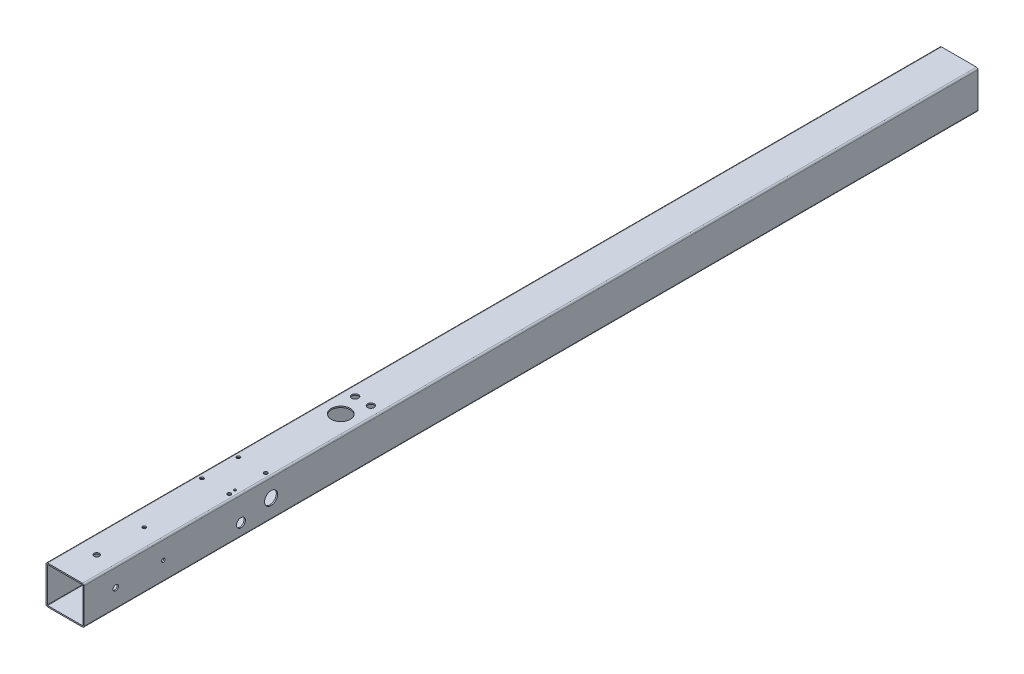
ISO-10303-21;
HEADER;
FILE_DESCRIPTION(('STEP AP214'),'2;1');
FILE_NAME('part.step','',(''),(''),'','','');
FILE_SCHEMA(('AUTOMOTIVE_DESIGN { 1 0 10303 214 1 1 1 1 }'));
ENDSEC;
DATA;
#1=APPLICATION_CONTEXT('core data for automotive mechanical design processes');
#2=APPLICATION_PROTOCOL_DEFINITION('international standard','automotive_design',2000,#1);
#3=PRODUCT_CONTEXT('',#1,'mechanical');
#4=PRODUCT('Part','Part','',(#3));
#5=PRODUCT_RELATED_PRODUCT_CATEGORY('part','',(#4));
#6=PRODUCT_DEFINITION_FORMATION('','',#4);
#7=PRODUCT_DEFINITION_CONTEXT('part definition',#1,'design');
#8=PRODUCT_DEFINITION('design','',#6,#7);
#9=PRODUCT_DEFINITION_SHAPE('','',#8);
#10=(LENGTH_UNIT() NAMED_UNIT(*) SI_UNIT(.MILLI.,.METRE.));
#11=(NAMED_UNIT(*) PLANE_ANGLE_UNIT() SI_UNIT($,.RADIAN.));
#12=(NAMED_UNIT(*) SI_UNIT($,.STERADIAN.) SOLID_ANGLE_UNIT());
#13=UNCERTAINTY_MEASURE_WITH_UNIT(LENGTH_MEASURE(1.E-05),#10,'distance_accuracy_value','');
#14=(GEOMETRIC_REPRESENTATION_CONTEXT(3) GLOBAL_UNCERTAINTY_ASSIGNED_CONTEXT((#13)) GLOBAL_UNIT_ASSIGNED_CONTEXT((#10,
#11,#12)) REPRESENTATION_CONTEXT('',''));
#15=CARTESIAN_POINT('',(0.,0.,0.));
#16=DIRECTION('',(0.,0.,1.));
#17=DIRECTION('',(1.,0.,0.));
#18=AXIS2_PLACEMENT_3D('',#15,#16,#17);
#19=CARTESIAN_POINT('',(115.,-115.,2820.));
#20=DIRECTION('',(0.,0.,1.));
#21=DIRECTION('',(1.,0.,0.));
#22=AXIS2_PLACEMENT_3D('',#19,#20,#21);
#23=PLANE('',#22);
#24=CARTESIAN_POINT('',(115.,-115.,2820.));
#25=DIRECTION('',(0.,0.,1.));
#26=DIRECTION('',(1.,0.,0.));
#27=AXIS2_PLACEMENT_3D('',#24,#25,#26);
#28=CIRCLE('',#27,5.);
#29=CARTESIAN_POINT('',(115.,-120.,2820.));
#30=VERTEX_POINT('',#29);
#31=CARTESIAN_POINT('',(120.,-115.,2820.));
#32=VERTEX_POINT('',#31);
#33=EDGE_CURVE('E234',#30,#32,#28,.T.);
#34=ORIENTED_EDGE('',*,*,#33,.T.);
#35=DIRECTION('',(0.,1.,0.));
#36=VECTOR('',#35,1.);
#37=CARTESIAN_POINT('',(120.,-5.00000000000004,2820.));
#38=LINE('',#37,#36);
#39=CARTESIAN_POINT('',(120.,-5.00000000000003,2820.));
#40=VERTEX_POINT('',#39);
#41=EDGE_CURVE('E237',#32,#40,#38,.T.);
#42=ORIENTED_EDGE('',*,*,#41,.T.);
#43=CARTESIAN_POINT('',(115.,-5.,2820.));
#44=DIRECTION('',(0.,0.,1.));
#45=DIRECTION('',(1.,0.,0.));
#46=AXIS2_PLACEMENT_3D('',#43,#44,#45);
#47=CIRCLE('',#46,5.);
#48=CARTESIAN_POINT('',(115.,0.,2820.));
#49=VERTEX_POINT('',#48);
#50=EDGE_CURVE('E239',#40,#49,#47,.T.);
#51=ORIENTED_EDGE('',*,*,#50,.T.);
#52=DIRECTION('',(-1.,0.,0.));
#53=VECTOR('',#52,1.);
#54=CARTESIAN_POINT('',(5.00000000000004,0.,2820.));
#55=LINE('',#54,#53);
#56=CARTESIAN_POINT('',(5.00000000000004,0.,2820.));
#57=VERTEX_POINT('',#56);
#58=EDGE_CURVE('E241',#49,#57,#55,.T.);
#59=ORIENTED_EDGE('',*,*,#58,.T.);
#60=CARTESIAN_POINT('',(5.,-5.,2820.));
#61=DIRECTION('',(0.,0.,1.));
#62=DIRECTION('',(1.,0.,0.));
#63=AXIS2_PLACEMENT_3D('',#60,#61,#62);
#64=CIRCLE('',#63,5.);
#65=CARTESIAN_POINT('',(0.,-5.00000000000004,2820.));
#66=VERTEX_POINT('',#65);
#67=EDGE_CURVE('E243',#57,#66,#64,.T.);
#68=ORIENTED_EDGE('',*,*,#67,.T.);
#69=DIRECTION('',(0.,-1.,0.));
#70=VECTOR('',#69,1.);
#71=CARTESIAN_POINT('',(0.,-5.00000000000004,2820.));
#72=LINE('',#71,#70);
#73=CARTESIAN_POINT('',(0.,-115.,2820.));
#74=VERTEX_POINT('',#73);
#75=EDGE_CURVE('E245',#66,#74,#72,.T.);
#76=ORIENTED_EDGE('',*,*,#75,.T.);
#77=CARTESIAN_POINT('',(5.00000000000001,-115.,2820.));
#78=DIRECTION('',(0.,0.,1.));
#79=DIRECTION('',(1.,0.,0.));
#80=AXIS2_PLACEMENT_3D('',#77,#78,#79);
#81=CIRCLE('',#80,5.);
#82=CARTESIAN_POINT('',(5.00000000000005,-120.,2820.));
#83=VERTEX_POINT('',#82);
#84=EDGE_CURVE('E247',#74,#83,#81,.T.);
#85=ORIENTED_EDGE('',*,*,#84,.T.);
#86=DIRECTION('',(1.,0.,0.));
#87=VECTOR('',#86,1.);
#88=CARTESIAN_POINT('',(5.00000000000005,-120.,2820.));
#89=LINE('',#88,#87);
#90=EDGE_CURVE('E249',#83,#30,#89,.T.);
#91=ORIENTED_EDGE('',*,*,#90,.T.);
#92=EDGE_LOOP('',(#34,#42,#51,#59,#68,#76,#85,#91));
#93=FACE_BOUND('',#92,.T.);
#94=DIRECTION('',(-1.,0.,0.));
#95=VECTOR('',#94,1.);
#96=CARTESIAN_POINT('',(5.00000000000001,-4.,2820.));
#97=LINE('',#96,#95);
#98=CARTESIAN_POINT('',(115.,-4.,2820.));
#99=VERTEX_POINT('',#98);
#100=CARTESIAN_POINT('',(5.00000000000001,-4.,2820.));
#101=VERTEX_POINT('',#100);
#102=EDGE_CURVE('E192',#99,#101,#97,.T.);
#103=ORIENTED_EDGE('',*,*,#102,.F.);
#104=CARTESIAN_POINT('',(115.,-5.,2820.));
#105=DIRECTION('',(0.,0.,1.));
#106=DIRECTION('',(1.,0.,0.));
#107=AXIS2_PLACEMENT_3D('',#104,#105,#106);
#108=CIRCLE('',#107,1.);
#109=CARTESIAN_POINT('',(116.,-5.00000000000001,2820.));
#110=VERTEX_POINT('',#109);
#111=EDGE_CURVE('E163',#110,#99,#108,.T.);
#112=ORIENTED_EDGE('',*,*,#111,.F.);
#113=DIRECTION('',(0.,1.,0.));
#114=VECTOR('',#113,1.);
#115=CARTESIAN_POINT('',(116.,-5.00000000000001,2820.));
#116=LINE('',#115,#114);
#117=CARTESIAN_POINT('',(116.,-115.,2820.));
#118=VERTEX_POINT('',#117);
#119=EDGE_CURVE('E204',#118,#110,#116,.T.);
#120=ORIENTED_EDGE('',*,*,#119,.F.);
#121=CARTESIAN_POINT('',(115.,-115.,2820.));
#122=DIRECTION('',(0.,0.,1.));
#123=DIRECTION('',(1.,0.,0.));
#124=AXIS2_PLACEMENT_3D('',#121,#122,#123);
#125=CIRCLE('',#124,1.);
#126=CARTESIAN_POINT('',(115.,-116.,2820.));
#127=VERTEX_POINT('',#126);
#128=EDGE_CURVE('E202',#127,#118,#125,.T.);
#129=ORIENTED_EDGE('',*,*,#128,.F.);
#130=DIRECTION('',(1.,0.,0.));
#131=VECTOR('',#130,1.);
#132=CARTESIAN_POINT('',(5.00000000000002,-116.,2820.));
#133=LINE('',#132,#131);
#134=CARTESIAN_POINT('',(5.00000000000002,-116.,2820.));
#135=VERTEX_POINT('',#134);
#136=EDGE_CURVE('E200',#135,#127,#133,.T.);
#137=ORIENTED_EDGE('',*,*,#136,.F.);
#138=CARTESIAN_POINT('',(5.00000000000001,-115.,2820.));
#139=DIRECTION('',(0.,0.,1.));
#140=DIRECTION('',(1.,0.,0.));
#141=AXIS2_PLACEMENT_3D('',#138,#139,#140);
#142=CIRCLE('',#141,1.);
#143=CARTESIAN_POINT('',(4.00000000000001,-115.,2820.));
#144=VERTEX_POINT('',#143);
#145=EDGE_CURVE('E198',#144,#135,#142,.T.);
#146=ORIENTED_EDGE('',*,*,#145,.F.);
#147=DIRECTION('',(0.,-1.,0.));
#148=VECTOR('',#147,1.);
#149=CARTESIAN_POINT('',(4.,-5.00000000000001,2820.));
#150=LINE('',#149,#148);
#151=CARTESIAN_POINT('',(4.,-5.00000000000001,2820.));
#152=VERTEX_POINT('',#151);
#153=EDGE_CURVE('E196',#152,#144,#150,.T.);
#154=ORIENTED_EDGE('',*,*,#153,.F.);
#155=CARTESIAN_POINT('',(5.,-5.,2820.));
#156=DIRECTION('',(0.,0.,1.));
#157=DIRECTION('',(1.,0.,0.));
#158=AXIS2_PLACEMENT_3D('',#155,#156,#157);
#159=CIRCLE('',#158,0.999999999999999);
#160=EDGE_CURVE('E194',#101,#152,#159,.T.);
#161=ORIENTED_EDGE('',*,*,#160,.F.);
#162=EDGE_LOOP('',(#103,#112,#120,#129,#137,#146,#154,#161));
#163=FACE_BOUND('',#162,.T.);
#164=ADVANCED_FACE('F33',(#93,#163),#23,.T.);
#165=CARTESIAN_POINT('',(115.,-115.,0.));
#166=DIRECTION('',(0.,0.,1.));
#167=DIRECTION('',(1.,0.,0.));
#168=AXIS2_PLACEMENT_3D('',#165,#166,#167);
#169=PLANE('',#168);
#170=CARTESIAN_POINT('',(115.,-115.,0.));
#171=DIRECTION('',(0.,0.,1.));
#172=DIRECTION('',(1.,0.,0.));
#173=AXIS2_PLACEMENT_3D('',#170,#171,#172);
#174=CIRCLE('',#173,5.);
#175=CARTESIAN_POINT('',(115.,-120.,0.));
#176=VERTEX_POINT('',#175);
#177=CARTESIAN_POINT('',(120.,-115.,0.));
#178=VERTEX_POINT('',#177);
#179=EDGE_CURVE('E164',#176,#178,#174,.T.);
#180=ORIENTED_EDGE('',*,*,#179,.F.);
#181=DIRECTION('',(1.,0.,0.));
#182=VECTOR('',#181,1.);
#183=CARTESIAN_POINT('',(5.00000000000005,-120.,0.));
#184=LINE('',#183,#182);
#185=CARTESIAN_POINT('',(5.00000000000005,-120.,0.));
#186=VERTEX_POINT('',#185);
#187=EDGE_CURVE('E232',#186,#176,#184,.T.);
#188=ORIENTED_EDGE('',*,*,#187,.F.);
#189=CARTESIAN_POINT('',(5.00000000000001,-115.,0.));
#190=DIRECTION('',(0.,0.,1.));
#191=DIRECTION('',(1.,0.,0.));
#192=AXIS2_PLACEMENT_3D('',#189,#190,#191);
#193=CIRCLE('',#192,5.);
#194=CARTESIAN_POINT('',(0.,-115.,0.));
#195=VERTEX_POINT('',#194);
#196=EDGE_CURVE('E230',#195,#186,#193,.T.);
#197=ORIENTED_EDGE('',*,*,#196,.F.);
#198=DIRECTION('',(0.,-1.,0.));
#199=VECTOR('',#198,1.);
#200=CARTESIAN_POINT('',(0.,-5.00000000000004,0.));
#201=LINE('',#200,#199);
#202=CARTESIAN_POINT('',(0.,-5.00000000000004,0.));
#203=VERTEX_POINT('',#202);
#204=EDGE_CURVE('E228',#203,#195,#201,.T.);
#205=ORIENTED_EDGE('',*,*,#204,.F.);
#206=CARTESIAN_POINT('',(5.,-5.,0.));
#207=DIRECTION('',(0.,0.,1.));
#208=DIRECTION('',(1.,0.,0.));
#209=AXIS2_PLACEMENT_3D('',#206,#207,#208);
#210=CIRCLE('',#209,5.);
#211=CARTESIAN_POINT('',(5.00000000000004,0.,0.));
#212=VERTEX_POINT('',#211);
#213=EDGE_CURVE('E226',#212,#203,#210,.T.);
#214=ORIENTED_EDGE('',*,*,#213,.F.);
#215=DIRECTION('',(-1.,0.,0.));
#216=VECTOR('',#215,1.);
#217=CARTESIAN_POINT('',(5.00000000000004,0.,0.));
#218=LINE('',#217,#216);
#219=CARTESIAN_POINT('',(115.,0.,0.));
#220=VERTEX_POINT('',#219);
#221=EDGE_CURVE('E224',#220,#212,#218,.T.);
#222=ORIENTED_EDGE('',*,*,#221,.F.);
#223=CARTESIAN_POINT('',(115.,-5.,0.));
#224=DIRECTION('',(0.,0.,1.));
#225=DIRECTION('',(1.,0.,0.));
#226=AXIS2_PLACEMENT_3D('',#223,#224,#225);
#227=CIRCLE('',#226,5.);
#228=CARTESIAN_POINT('',(120.,-5.00000000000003,0.));
#229=VERTEX_POINT('',#228);
#230=EDGE_CURVE('E222',#229,#220,#227,.T.);
#231=ORIENTED_EDGE('',*,*,#230,.F.);
#232=DIRECTION('',(0.,1.,0.));
#233=VECTOR('',#232,1.);
#234=CARTESIAN_POINT('',(120.,-5.00000000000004,0.));
#235=LINE('',#234,#233);
#236=EDGE_CURVE('E220',#178,#229,#235,.T.);
#237=ORIENTED_EDGE('',*,*,#236,.F.);
#238=EDGE_LOOP('',(#180,#188,#197,#205,#214,#222,#231,#237));
#239=FACE_BOUND('',#238,.T.);
#240=CARTESIAN_POINT('',(115.,-5.,0.));
#241=DIRECTION('',(0.,0.,1.));
#242=DIRECTION('',(1.,0.,0.));
#243=AXIS2_PLACEMENT_3D('',#240,#241,#242);
#244=CIRCLE('',#243,1.);
#245=CARTESIAN_POINT('',(116.,-5.,0.));
#246=VERTEX_POINT('',#245);
#247=CARTESIAN_POINT('',(115.,-4.,0.));
#248=VERTEX_POINT('',#247);
#249=EDGE_CURVE('E58',#246,#248,#244,.T.);
#250=ORIENTED_EDGE('',*,*,#249,.T.);
#251=DIRECTION('',(-1.,0.,0.));
#252=VECTOR('',#251,1.);
#253=CARTESIAN_POINT('',(5.00000000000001,-4.,0.));
#254=LINE('',#253,#252);
#255=CARTESIAN_POINT('',(5.00000000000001,-4.,0.));
#256=VERTEX_POINT('',#255);
#257=EDGE_CURVE('E150',#248,#256,#254,.T.);
#258=ORIENTED_EDGE('',*,*,#257,.T.);
#259=CARTESIAN_POINT('',(5.,-5.,0.));
#260=DIRECTION('',(0.,0.,1.));
#261=DIRECTION('',(1.,0.,0.));
#262=AXIS2_PLACEMENT_3D('',#259,#260,#261);
#263=CIRCLE('',#262,0.999999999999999);
#264=CARTESIAN_POINT('',(4.,-5.00000000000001,0.));
#265=VERTEX_POINT('',#264);
#266=EDGE_CURVE('E159',#256,#265,#263,.T.);
#267=ORIENTED_EDGE('',*,*,#266,.T.);
#268=DIRECTION('',(0.,-1.,0.));
#269=VECTOR('',#268,1.);
#270=CARTESIAN_POINT('',(4.,-5.00000000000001,0.));
#271=LINE('',#270,#269);
#272=CARTESIAN_POINT('',(4.00000000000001,-115.,0.));
#273=VERTEX_POINT('',#272);
#274=EDGE_CURVE('E179',#265,#273,#271,.T.);
#275=ORIENTED_EDGE('',*,*,#274,.T.);
#276=CARTESIAN_POINT('',(5.00000000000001,-115.,0.));
#277=DIRECTION('',(0.,0.,1.));
#278=DIRECTION('',(1.,0.,0.));
#279=AXIS2_PLACEMENT_3D('',#276,#277,#278);
#280=CIRCLE('',#279,1.);
#281=CARTESIAN_POINT('',(5.00000000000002,-116.,0.));
#282=VERTEX_POINT('',#281);
#283=EDGE_CURVE('E182',#273,#282,#280,.T.);
#284=ORIENTED_EDGE('',*,*,#283,.T.);
#285=DIRECTION('',(1.,0.,0.));
#286=VECTOR('',#285,1.);
#287=CARTESIAN_POINT('',(5.00000000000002,-116.,0.));
#288=LINE('',#287,#286);
#289=CARTESIAN_POINT('',(115.,-116.,0.));
#290=VERTEX_POINT('',#289);
#291=EDGE_CURVE('E185',#282,#290,#288,.T.);
#292=ORIENTED_EDGE('',*,*,#291,.T.);
#293=CARTESIAN_POINT('',(115.,-115.,0.));
#294=DIRECTION('',(0.,0.,1.));
#295=DIRECTION('',(1.,0.,0.));
#296=AXIS2_PLACEMENT_3D('',#293,#294,#295);
#297=CIRCLE('',#296,1.);
#298=CARTESIAN_POINT('',(116.,-115.,0.));
#299=VERTEX_POINT('',#298);
#300=EDGE_CURVE('E188',#290,#299,#297,.T.);
#301=ORIENTED_EDGE('',*,*,#300,.T.);
#302=DIRECTION('',(0.,1.,0.));
#303=VECTOR('',#302,1.);
#304=CARTESIAN_POINT('',(116.,-5.00000000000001,0.));
#305=LINE('',#304,#303);
#306=EDGE_CURVE('E169',#299,#246,#305,.T.);
#307=ORIENTED_EDGE('',*,*,#306,.T.);
#308=EDGE_LOOP('',(#250,#258,#267,#275,#284,#292,#301,#307));
#309=FACE_BOUND('',#308,.T.);
#310=ADVANCED_FACE('F167',(#239,#309),#169,.F.);
#311=CARTESIAN_POINT('',(115.,-115.,2820.));
#312=DIRECTION('',(0.,0.,-1.));
#313=DIRECTION('',(-1.,0.,0.));
#314=AXIS2_PLACEMENT_3D('',#311,#312,#313);
#315=CYLINDRICAL_SURFACE('',#314,5.);
#316=ORIENTED_EDGE('',*,*,#179,.T.);
#317=DIRECTION('',(0.,0.,-1.));
#318=VECTOR('',#317,1.);
#319=CARTESIAN_POINT('',(120.,-115.,2820.));
#320=LINE('',#319,#318);
#321=EDGE_CURVE('E11',#32,#178,#320,.T.);
#322=ORIENTED_EDGE('',*,*,#321,.F.);
#323=ORIENTED_EDGE('',*,*,#33,.F.);
#324=DIRECTION('',(0.,0.,-1.));
#325=VECTOR('',#324,1.);
#326=CARTESIAN_POINT('',(115.,-120.,2820.));
#327=LINE('',#326,#325);
#328=EDGE_CURVE('E251',#30,#176,#327,.T.);
#329=ORIENTED_EDGE('',*,*,#328,.T.);
#330=EDGE_LOOP('',(#316,#322,#323,#329));
#331=FACE_BOUND('',#330,.T.);
#332=ADVANCED_FACE('F35',(#331),#315,.T.);
#333=CARTESIAN_POINT('',(120.,-5.00000000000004,2820.));
#334=DIRECTION('',(-1.,0.,0.));
#335=DIRECTION('',(0.,0.,1.));
#336=AXIS2_PLACEMENT_3D('',#333,#334,#335);
#337=PLANE('',#336);
#338=CARTESIAN_POINT('',(120.,-60.,2230.));
#339=DIRECTION('',(-1.,0.,0.));
#340=DIRECTION('',(0.,-1.,0.));
#341=AXIS2_PLACEMENT_3D('',#338,#339,#340);
#342=CIRCLE('',#341,20.5000000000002);
#343=CARTESIAN_POINT('',(120.,-80.5000000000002,2230.));
#344=VERTEX_POINT('',#343);
#345=EDGE_CURVE('E322',#344,#344,#342,.T.);
#346=ORIENTED_EDGE('',*,*,#345,.T.);
#347=EDGE_LOOP('',(#346));
#348=FACE_BOUND('',#347,.T.);
#349=CARTESIAN_POINT('',(120.,-80.,2325.));
#350=DIRECTION('',(-1.,0.,0.));
#351=DIRECTION('',(0.,-1.,0.));
#352=AXIS2_PLACEMENT_3D('',#349,#350,#351);
#353=CIRCLE('',#352,13.9999999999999);
#354=CARTESIAN_POINT('',(120.,-93.9999999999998,2325.));
#355=VERTEX_POINT('',#354);
#356=EDGE_CURVE('E317',#355,#355,#353,.T.);
#357=ORIENTED_EDGE('',*,*,#356,.T.);
#358=EDGE_LOOP('',(#357));
#359=FACE_BOUND('',#358,.T.);
#360=CARTESIAN_POINT('',(120.,-60.,2570.));
#361=DIRECTION('',(-1.,0.,0.));
#362=DIRECTION('',(0.,-1.,0.));
#363=AXIS2_PLACEMENT_3D('',#360,#361,#362);
#364=CIRCLE('',#363,5.49999999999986);
#365=CARTESIAN_POINT('',(120.,-65.4999999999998,2570.));
#366=VERTEX_POINT('',#365);
#367=EDGE_CURVE('E312',#366,#366,#364,.T.);
#368=ORIENTED_EDGE('',*,*,#367,.T.);
#369=EDGE_LOOP('',(#368));
#370=FACE_BOUND('',#369,.T.);
#371=CARTESIAN_POINT('',(120.,-60.,2720.));
#372=DIRECTION('',(-1.,0.,0.));
#373=DIRECTION('',(0.,-1.,0.));
#374=AXIS2_PLACEMENT_3D('',#371,#372,#373);
#375=CIRCLE('',#374,8.50000000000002);
#376=CARTESIAN_POINT('',(120.,-68.5,2720.));
#377=VERTEX_POINT('',#376);
#378=EDGE_CURVE('E307',#377,#377,#375,.T.);
#379=ORIENTED_EDGE('',*,*,#378,.T.);
#380=EDGE_LOOP('',(#379));
#381=FACE_BOUND('',#380,.T.);
#382=ORIENTED_EDGE('',*,*,#236,.T.);
#383=DIRECTION('',(0.,0.,-1.));
#384=VECTOR('',#383,1.);
#385=CARTESIAN_POINT('',(120.,-5.00000000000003,2820.));
#386=LINE('',#385,#384);
#387=EDGE_CURVE('E42',#40,#229,#386,.T.);
#388=ORIENTED_EDGE('',*,*,#387,.F.);
#389=ORIENTED_EDGE('',*,*,#41,.F.);
#390=ORIENTED_EDGE('',*,*,#321,.T.);
#391=EDGE_LOOP('',(#382,#388,#389,#390));
#392=FACE_BOUND('',#391,.T.);
#393=ADVANCED_FACE('F429',(#348,#359,#370,#381,#392),#337,.F.);
#394=CARTESIAN_POINT('',(115.,-5.,2820.));
#395=DIRECTION('',(0.,0.,-1.));
#396=DIRECTION('',(-1.,0.,0.));
#397=AXIS2_PLACEMENT_3D('',#394,#395,#396);
#398=CYLINDRICAL_SURFACE('',#397,5.);
#399=ORIENTED_EDGE('',*,*,#230,.T.);
#400=DIRECTION('',(0.,0.,-1.));
#401=VECTOR('',#400,1.);
#402=CARTESIAN_POINT('',(115.,0.,2820.));
#403=LINE('',#402,#401);
#404=EDGE_CURVE('E266',#49,#220,#403,.T.);
#405=ORIENTED_EDGE('',*,*,#404,.F.);
#406=ORIENTED_EDGE('',*,*,#50,.F.);
#407=ORIENTED_EDGE('',*,*,#387,.T.);
#408=EDGE_LOOP('',(#399,#405,#406,#407));
#409=FACE_BOUND('',#408,.T.);
#410=ADVANCED_FACE('F392',(#409),#398,.T.);
#411=CARTESIAN_POINT('',(5.00000000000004,0.,2820.));
#412=DIRECTION('',(0.,-1.,0.));
#413=DIRECTION('',(0.,0.,-1.));
#414=AXIS2_PLACEMENT_3D('',#411,#412,#413);
#415=PLANE('',#414);
#416=CARTESIAN_POINT('',(101.,0.,2325.));
#417=DIRECTION('',(0.,-1.,0.));
#418=DIRECTION('',(0.,0.,-1.));
#419=AXIS2_PLACEMENT_3D('',#416,#417,#418);
#420=CIRCLE('',#419,3.49999999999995);
#421=CARTESIAN_POINT('',(101.,0.,2321.5));
#422=VERTEX_POINT('',#421);
#423=EDGE_CURVE('E554',#422,#422,#420,.T.);
#424=ORIENTED_EDGE('',*,*,#423,.T.);
#425=EDGE_LOOP('',(#424));
#426=FACE_BOUND('',#425,.T.);
#427=CARTESIAN_POINT('',(85.,0.,1880.));
#428=DIRECTION('',(0.,1.,0.));
#429=DIRECTION('',(0.,0.,1.));
#430=AXIS2_PLACEMENT_3D('',#427,#428,#429);
#431=CIRCLE('',#430,10.5);
#432=CARTESIAN_POINT('',(85.,0.,1890.5));
#433=VERTEX_POINT('',#432);
#434=EDGE_CURVE('E302',#433,#433,#431,.T.);
#435=ORIENTED_EDGE('',*,*,#434,.F.);
#436=EDGE_LOOP('',(#435));
#437=FACE_BOUND('',#436,.T.);
#438=CARTESIAN_POINT('',(35.,0.,1880.));
#439=DIRECTION('',(0.,1.,0.));
#440=DIRECTION('',(0.,0.,1.));
#441=AXIS2_PLACEMENT_3D('',#438,#439,#440);
#442=CIRCLE('',#441,10.5);
#443=CARTESIAN_POINT('',(35.,0.,1890.5));
#444=VERTEX_POINT('',#443);
#445=EDGE_CURVE('E298',#444,#444,#442,.T.);
#446=ORIENTED_EDGE('',*,*,#445,.F.);
#447=EDGE_LOOP('',(#446));
#448=FACE_BOUND('',#447,.T.);
#449=CARTESIAN_POINT('',(103.,0.,2230.));
#450=DIRECTION('',(0.,1.,0.));
#451=DIRECTION('',(0.,0.,1.));
#452=AXIS2_PLACEMENT_3D('',#449,#450,#451);
#453=CIRCLE('',#452,5.49999999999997);
#454=CARTESIAN_POINT('',(103.,0.,2235.5));
#455=VERTEX_POINT('',#454);
#456=EDGE_CURVE('E294',#455,#455,#453,.T.);
#457=ORIENTED_EDGE('',*,*,#456,.F.);
#458=EDGE_LOOP('',(#457));
#459=FACE_BOUND('',#458,.T.);
#460=CARTESIAN_POINT('',(103.,0.,2345.));
#461=DIRECTION('',(0.,1.,0.));
#462=DIRECTION('',(0.,0.,1.));
#463=AXIS2_PLACEMENT_3D('',#460,#461,#462);
#464=CIRCLE('',#463,5.49999999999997);
#465=CARTESIAN_POINT('',(103.,0.,2350.5));
#466=VERTEX_POINT('',#465);
#467=EDGE_CURVE('E290',#466,#466,#464,.T.);
#468=ORIENTED_EDGE('',*,*,#467,.F.);
#469=EDGE_LOOP('',(#468));
#470=FACE_BOUND('',#469,.T.);
#471=CARTESIAN_POINT('',(17.,0.,2345.));
#472=DIRECTION('',(0.,1.,0.));
#473=DIRECTION('',(0.,0.,1.));
#474=AXIS2_PLACEMENT_3D('',#471,#472,#473);
#475=CIRCLE('',#474,5.49999999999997);
#476=CARTESIAN_POINT('',(17.,0.,2350.5));
#477=VERTEX_POINT('',#476);
#478=EDGE_CURVE('E286',#477,#477,#475,.T.);
#479=ORIENTED_EDGE('',*,*,#478,.F.);
#480=EDGE_LOOP('',(#479));
#481=FACE_BOUND('',#480,.T.);
#482=CARTESIAN_POINT('',(17.,0.,2230.));
#483=DIRECTION('',(0.,1.,0.));
#484=DIRECTION('',(0.,0.,1.));
#485=AXIS2_PLACEMENT_3D('',#482,#483,#484);
#486=CIRCLE('',#485,5.49999999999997);
#487=CARTESIAN_POINT('',(17.,0.,2235.5));
#488=VERTEX_POINT('',#487);
#489=EDGE_CURVE('E282',#488,#488,#486,.T.);
#490=ORIENTED_EDGE('',*,*,#489,.F.);
#491=EDGE_LOOP('',(#490));
#492=FACE_BOUND('',#491,.T.);
#493=CARTESIAN_POINT('',(60.,0.,1950.));
#494=DIRECTION('',(0.,1.,0.));
#495=DIRECTION('',(0.,0.,1.));
#496=AXIS2_PLACEMENT_3D('',#493,#494,#495);
#497=CIRCLE('',#496,30.);
#498=CARTESIAN_POINT('',(60.,0.,1980.));
#499=VERTEX_POINT('',#498);
#500=EDGE_CURVE('E278',#499,#499,#497,.T.);
#501=ORIENTED_EDGE('',*,*,#500,.F.);
#502=EDGE_LOOP('',(#501));
#503=FACE_BOUND('',#502,.T.);
#504=CARTESIAN_POINT('',(60.,0.,2570.));
#505=DIRECTION('',(0.,1.,0.));
#506=DIRECTION('',(0.,0.,1.));
#507=AXIS2_PLACEMENT_3D('',#504,#505,#506);
#508=CIRCLE('',#507,5.49999999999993);
#509=CARTESIAN_POINT('',(60.,0.,2575.5));
#510=VERTEX_POINT('',#509);
#511=EDGE_CURVE('E274',#510,#510,#508,.T.);
#512=ORIENTED_EDGE('',*,*,#511,.F.);
#513=EDGE_LOOP('',(#512));
#514=FACE_BOUND('',#513,.T.);
#515=CARTESIAN_POINT('',(60.,0.,2720.));
#516=DIRECTION('',(0.,1.,0.));
#517=DIRECTION('',(0.,0.,1.));
#518=AXIS2_PLACEMENT_3D('',#515,#516,#517);
#519=CIRCLE('',#518,8.50000000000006);
#520=CARTESIAN_POINT('',(60.,0.,2728.5));
#521=VERTEX_POINT('',#520);
#522=EDGE_CURVE('E173',#521,#521,#519,.T.);
#523=ORIENTED_EDGE('',*,*,#522,.F.);
#524=EDGE_LOOP('',(#523));
#525=FACE_BOUND('',#524,.T.);
#526=ORIENTED_EDGE('',*,*,#221,.T.);
#527=DIRECTION('',(0.,0.,-1.));
#528=VECTOR('',#527,1.);
#529=CARTESIAN_POINT('',(5.00000000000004,0.,2820.));
#530=LINE('',#529,#528);
#531=EDGE_CURVE('E263',#57,#212,#530,.T.);
#532=ORIENTED_EDGE('',*,*,#531,.F.);
#533=ORIENTED_EDGE('',*,*,#58,.F.);
#534=ORIENTED_EDGE('',*,*,#404,.T.);
#535=EDGE_LOOP('',(#526,#532,#533,#534));
#536=FACE_BOUND('',#535,.T.);
#537=ADVANCED_FACE('F388',(#426,#437,#448,#459,#470,#481,#492,#503,#514,#525,#536),#415,.F.);
#538=CARTESIAN_POINT('',(5.,-5.,2820.));
#539=DIRECTION('',(0.,0.,-1.));
#540=DIRECTION('',(-1.,0.,0.));
#541=AXIS2_PLACEMENT_3D('',#538,#539,#540);
#542=CYLINDRICAL_SURFACE('',#541,5.);
#543=ORIENTED_EDGE('',*,*,#213,.T.);
#544=DIRECTION('',(0.,0.,-1.));
#545=VECTOR('',#544,1.);
#546=CARTESIAN_POINT('',(0.,-5.00000000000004,2820.));
#547=LINE('',#546,#545);
#548=EDGE_CURVE('E260',#66,#203,#547,.T.);
#549=ORIENTED_EDGE('',*,*,#548,.F.);
#550=ORIENTED_EDGE('',*,*,#67,.F.);
#551=ORIENTED_EDGE('',*,*,#531,.T.);
#552=EDGE_LOOP('',(#543,#549,#550,#551));
#553=FACE_BOUND('',#552,.T.);
#554=ADVANCED_FACE('F391',(#553),#542,.T.);
#555=CARTESIAN_POINT('',(0.,-5.00000000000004,2820.));
#556=DIRECTION('',(1.,0.,0.));
#557=DIRECTION('',(0.,1.,0.));
#558=AXIS2_PLACEMENT_3D('',#555,#556,#557);
#559=PLANE('',#558);
#560=CARTESIAN_POINT('',(0.,-60.,2230.));
#561=DIRECTION('',(-1.,0.,0.));
#562=DIRECTION('',(0.,-1.,0.));
#563=AXIS2_PLACEMENT_3D('',#560,#561,#562);
#564=CIRCLE('',#563,20.5000000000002);
#565=CARTESIAN_POINT('',(0.,-80.5000000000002,2230.));
#566=VERTEX_POINT('',#565);
#567=EDGE_CURVE('E325',#566,#566,#564,.T.);
#568=ORIENTED_EDGE('',*,*,#567,.F.);
#569=EDGE_LOOP('',(#568));
#570=FACE_BOUND('',#569,.T.);
#571=CARTESIAN_POINT('',(0.,-80.,2325.));
#572=DIRECTION('',(-1.,0.,0.));
#573=DIRECTION('',(0.,-1.,0.));
#574=AXIS2_PLACEMENT_3D('',#571,#572,#573);
#575=CIRCLE('',#574,13.9999999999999);
#576=CARTESIAN_POINT('',(0.,-93.9999999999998,2325.));
#577=VERTEX_POINT('',#576);
#578=EDGE_CURVE('E349',#577,#577,#575,.T.);
#579=ORIENTED_EDGE('',*,*,#578,.F.);
#580=EDGE_LOOP('',(#579));
#581=FACE_BOUND('',#580,.T.);
#582=CARTESIAN_POINT('',(0.,-60.,2570.));
#583=DIRECTION('',(-1.,0.,0.));
#584=DIRECTION('',(0.,-1.,0.));
#585=AXIS2_PLACEMENT_3D('',#582,#583,#584);
#586=CIRCLE('',#585,5.49999999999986);
#587=CARTESIAN_POINT('',(0.,-65.4999999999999,2570.));
#588=VERTEX_POINT('',#587);
#589=EDGE_CURVE('E356',#588,#588,#586,.T.);
#590=ORIENTED_EDGE('',*,*,#589,.F.);
#591=EDGE_LOOP('',(#590));
#592=FACE_BOUND('',#591,.T.);
#593=CARTESIAN_POINT('',(0.,-60.,2720.));
#594=DIRECTION('',(-1.,0.,0.));
#595=DIRECTION('',(0.,-1.,0.));
#596=AXIS2_PLACEMENT_3D('',#593,#594,#595);
#597=CIRCLE('',#596,8.50000000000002);
#598=CARTESIAN_POINT('',(0.,-68.5,2720.));
#599=VERTEX_POINT('',#598);
#600=EDGE_CURVE('E363',#599,#599,#597,.T.);
#601=ORIENTED_EDGE('',*,*,#600,.F.);
#602=EDGE_LOOP('',(#601));
#603=FACE_BOUND('',#602,.T.);
#604=ORIENTED_EDGE('',*,*,#204,.T.);
#605=DIRECTION('',(0.,0.,-1.));
#606=VECTOR('',#605,1.);
#607=CARTESIAN_POINT('',(0.,-115.,2820.));
#608=LINE('',#607,#606);
#609=EDGE_CURVE('E257',#74,#195,#608,.T.);
#610=ORIENTED_EDGE('',*,*,#609,.F.);
#611=ORIENTED_EDGE('',*,*,#75,.F.);
#612=ORIENTED_EDGE('',*,*,#548,.T.);
#613=EDGE_LOOP('',(#604,#610,#611,#612));
#614=FACE_BOUND('',#613,.T.);
#615=ADVANCED_FACE('F414',(#570,#581,#592,#603,#614),#559,.F.);
#616=CARTESIAN_POINT('',(5.00000000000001,-115.,2820.));
#617=DIRECTION('',(0.,0.,-1.));
#618=DIRECTION('',(-1.,0.,0.));
#619=AXIS2_PLACEMENT_3D('',#616,#617,#618);
#620=CYLINDRICAL_SURFACE('',#619,5.);
#621=ORIENTED_EDGE('',*,*,#196,.T.);
#622=DIRECTION('',(0.,0.,-1.));
#623=VECTOR('',#622,1.);
#624=CARTESIAN_POINT('',(5.00000000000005,-120.,2820.));
#625=LINE('',#624,#623);
#626=EDGE_CURVE('E254',#83,#186,#625,.T.);
#627=ORIENTED_EDGE('',*,*,#626,.F.);
#628=ORIENTED_EDGE('',*,*,#84,.F.);
#629=ORIENTED_EDGE('',*,*,#609,.T.);
#630=EDGE_LOOP('',(#621,#627,#628,#629));
#631=FACE_BOUND('',#630,.T.);
#632=ADVANCED_FACE('F418',(#631),#620,.T.);
#633=CARTESIAN_POINT('',(5.00000000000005,-120.,2820.));
#634=DIRECTION('',(0.,1.,0.));
#635=DIRECTION('',(0.,0.,1.));
#636=AXIS2_PLACEMENT_3D('',#633,#634,#635);
#637=PLANE('',#636);
#638=CARTESIAN_POINT('',(101.,-120.,2325.));
#639=DIRECTION('',(0.,-1.,0.));
#640=DIRECTION('',(0.,0.,-1.));
#641=AXIS2_PLACEMENT_3D('',#638,#639,#640);
#642=CIRCLE('',#641,3.49999999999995);
#643=CARTESIAN_POINT('',(101.,-120.,2321.5));
#644=VERTEX_POINT('',#643);
#645=EDGE_CURVE('E553',#644,#644,#642,.T.);
#646=ORIENTED_EDGE('',*,*,#645,.F.);
#647=EDGE_LOOP('',(#646));
#648=FACE_BOUND('',#647,.T.);
#649=CARTESIAN_POINT('',(60.,-120.,2570.));
#650=DIRECTION('',(0.,-1.,0.));
#651=DIRECTION('',(0.,0.,-1.));
#652=AXIS2_PLACEMENT_3D('',#649,#650,#651);
#653=CIRCLE('',#652,5.49999999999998);
#654=CARTESIAN_POINT('',(60.,-120.,2564.5));
#655=VERTEX_POINT('',#654);
#656=EDGE_CURVE('E329',#655,#655,#653,.T.);
#657=ORIENTED_EDGE('',*,*,#656,.F.);
#658=EDGE_LOOP('',(#657));
#659=FACE_BOUND('',#658,.T.);
#660=CARTESIAN_POINT('',(60.,-120.,2720.));
#661=DIRECTION('',(0.,-1.,0.));
#662=DIRECTION('',(0.,0.,-1.));
#663=AXIS2_PLACEMENT_3D('',#660,#661,#662);
#664=CIRCLE('',#663,8.5000000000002);
#665=CARTESIAN_POINT('',(60.,-120.,2711.5));
#666=VERTEX_POINT('',#665);
#667=EDGE_CURVE('E326',#666,#666,#664,.T.);
#668=ORIENTED_EDGE('',*,*,#667,.F.);
#669=EDGE_LOOP('',(#668));
#670=FACE_BOUND('',#669,.T.);
#671=ORIENTED_EDGE('',*,*,#187,.T.);
#672=ORIENTED_EDGE('',*,*,#328,.F.);
#673=ORIENTED_EDGE('',*,*,#90,.F.);
#674=ORIENTED_EDGE('',*,*,#626,.T.);
#675=EDGE_LOOP('',(#671,#672,#673,#674));
#676=FACE_BOUND('',#675,.T.);
#677=ADVANCED_FACE('F433',(#648,#659,#670,#676),#637,.F.);
#678=CARTESIAN_POINT('',(115.,-5.,2820.));
#679=DIRECTION('',(0.,0.,-1.));
#680=DIRECTION('',(-1.,0.,0.));
#681=AXIS2_PLACEMENT_3D('',#678,#679,#680);
#682=CYLINDRICAL_SURFACE('',#681,1.);
#683=ORIENTED_EDGE('',*,*,#249,.F.);
#684=DIRECTION('',(0.,0.,-1.));
#685=VECTOR('',#684,1.);
#686=CARTESIAN_POINT('',(116.,-5.00000000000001,2820.));
#687=LINE('',#686,#685);
#688=EDGE_CURVE('E206',#110,#246,#687,.T.);
#689=ORIENTED_EDGE('',*,*,#688,.F.);
#690=ORIENTED_EDGE('',*,*,#111,.T.);
#691=DIRECTION('',(0.,0.,-1.));
#692=VECTOR('',#691,1.);
#693=CARTESIAN_POINT('',(115.,-4.,2820.));
#694=LINE('',#693,#692);
#695=EDGE_CURVE('E152',#99,#248,#694,.T.);
#696=ORIENTED_EDGE('',*,*,#695,.T.);
#697=EDGE_LOOP('',(#683,#689,#690,#696));
#698=FACE_BOUND('',#697,.T.);
#699=ADVANCED_FACE('F161',(#698),#682,.F.);
#700=CARTESIAN_POINT('',(5.00000000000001,-4.,2820.));
#701=DIRECTION('',(0.,-1.,0.));
#702=DIRECTION('',(0.,0.,-1.));
#703=AXIS2_PLACEMENT_3D('',#700,#701,#702);
#704=PLANE('',#703);
#705=CARTESIAN_POINT('',(101.,-4.,2325.));
#706=DIRECTION('',(0.,-1.,0.));
#707=DIRECTION('',(0.,0.,-1.));
#708=AXIS2_PLACEMENT_3D('',#705,#706,#707);
#709=CIRCLE('',#708,3.49999999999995);
#710=CARTESIAN_POINT('',(101.,-4.,2321.5));
#711=VERTEX_POINT('',#710);
#712=EDGE_CURVE('E335',#711,#711,#709,.T.);
#713=ORIENTED_EDGE('',*,*,#712,.F.);
#714=EDGE_LOOP('',(#713));
#715=FACE_BOUND('',#714,.T.);
#716=CARTESIAN_POINT('',(85.,-4.,1880.));
#717=DIRECTION('',(0.,-1.,0.));
#718=DIRECTION('',(0.,0.,-1.));
#719=AXIS2_PLACEMENT_3D('',#716,#717,#718);
#720=CIRCLE('',#719,10.5);
#721=CARTESIAN_POINT('',(85.,-4.,1869.5));
#722=VERTEX_POINT('',#721);
#723=EDGE_CURVE('E299',#722,#722,#720,.T.);
#724=ORIENTED_EDGE('',*,*,#723,.F.);
#725=EDGE_LOOP('',(#724));
#726=FACE_BOUND('',#725,.T.);
#727=CARTESIAN_POINT('',(35.,-4.,1880.));
#728=DIRECTION('',(0.,-1.,0.));
#729=DIRECTION('',(0.,0.,-1.));
#730=AXIS2_PLACEMENT_3D('',#727,#728,#729);
#731=CIRCLE('',#730,10.5);
#732=CARTESIAN_POINT('',(35.,-4.,1869.5));
#733=VERTEX_POINT('',#732);
#734=EDGE_CURVE('E295',#733,#733,#731,.T.);
#735=ORIENTED_EDGE('',*,*,#734,.F.);
#736=EDGE_LOOP('',(#735));
#737=FACE_BOUND('',#736,.T.);
#738=CARTESIAN_POINT('',(103.,-4.,2230.));
#739=DIRECTION('',(0.,-1.,0.));
#740=DIRECTION('',(0.,0.,-1.));
#741=AXIS2_PLACEMENT_3D('',#738,#739,#740);
#742=CIRCLE('',#741,5.49999999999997);
#743=CARTESIAN_POINT('',(103.,-4.,2224.5));
#744=VERTEX_POINT('',#743);
#745=EDGE_CURVE('E291',#744,#744,#742,.T.);
#746=ORIENTED_EDGE('',*,*,#745,.F.);
#747=EDGE_LOOP('',(#746));
#748=FACE_BOUND('',#747,.T.);
#749=CARTESIAN_POINT('',(103.,-4.,2345.));
#750=DIRECTION('',(0.,-1.,0.));
#751=DIRECTION('',(0.,0.,-1.));
#752=AXIS2_PLACEMENT_3D('',#749,#750,#751);
#753=CIRCLE('',#752,5.49999999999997);
#754=CARTESIAN_POINT('',(103.,-4.,2339.5));
#755=VERTEX_POINT('',#754);
#756=EDGE_CURVE('E287',#755,#755,#753,.T.);
#757=ORIENTED_EDGE('',*,*,#756,.F.);
#758=EDGE_LOOP('',(#757));
#759=FACE_BOUND('',#758,.T.);
#760=CARTESIAN_POINT('',(17.,-4.,2345.));
#761=DIRECTION('',(0.,-1.,0.));
#762=DIRECTION('',(0.,0.,-1.));
#763=AXIS2_PLACEMENT_3D('',#760,#761,#762);
#764=CIRCLE('',#763,5.49999999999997);
#765=CARTESIAN_POINT('',(17.,-4.,2339.5));
#766=VERTEX_POINT('',#765);
#767=EDGE_CURVE('E283',#766,#766,#764,.T.);
#768=ORIENTED_EDGE('',*,*,#767,.F.);
#769=EDGE_LOOP('',(#768));
#770=FACE_BOUND('',#769,.T.);
#771=CARTESIAN_POINT('',(17.,-4.,2230.));
#772=DIRECTION('',(0.,-1.,0.));
#773=DIRECTION('',(0.,0.,-1.));
#774=AXIS2_PLACEMENT_3D('',#771,#772,#773);
#775=CIRCLE('',#774,5.49999999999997);
#776=CARTESIAN_POINT('',(17.,-4.,2224.5));
#777=VERTEX_POINT('',#776);
#778=EDGE_CURVE('E279',#777,#777,#775,.T.);
#779=ORIENTED_EDGE('',*,*,#778,.F.);
#780=EDGE_LOOP('',(#779));
#781=FACE_BOUND('',#780,.T.);
#782=CARTESIAN_POINT('',(60.,-4.,1950.));
#783=DIRECTION('',(0.,-1.,0.));
#784=DIRECTION('',(0.,0.,-1.));
#785=AXIS2_PLACEMENT_3D('',#782,#783,#784);
#786=CIRCLE('',#785,30.);
#787=CARTESIAN_POINT('',(60.,-4.,1920.));
#788=VERTEX_POINT('',#787);
#789=EDGE_CURVE('E275',#788,#788,#786,.T.);
#790=ORIENTED_EDGE('',*,*,#789,.F.);
#791=EDGE_LOOP('',(#790));
#792=FACE_BOUND('',#791,.T.);
#793=CARTESIAN_POINT('',(60.,-4.,2570.));
#794=DIRECTION('',(0.,-1.,0.));
#795=DIRECTION('',(0.,0.,-1.));
#796=AXIS2_PLACEMENT_3D('',#793,#794,#795);
#797=CIRCLE('',#796,5.49999999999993);
#798=CARTESIAN_POINT('',(60.,-4.,2564.5));
#799=VERTEX_POINT('',#798);
#800=EDGE_CURVE('E271',#799,#799,#797,.T.);
#801=ORIENTED_EDGE('',*,*,#800,.F.);
#802=EDGE_LOOP('',(#801));
#803=FACE_BOUND('',#802,.T.);
#804=CARTESIAN_POINT('',(60.,-4.,2720.));
#805=DIRECTION('',(0.,-1.,0.));
#806=DIRECTION('',(0.,0.,-1.));
#807=AXIS2_PLACEMENT_3D('',#804,#805,#806);
#808=CIRCLE('',#807,8.50000000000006);
#809=CARTESIAN_POINT('',(60.,-4.,2711.5));
#810=VERTEX_POINT('',#809);
#811=EDGE_CURVE('E170',#810,#810,#808,.T.);
#812=ORIENTED_EDGE('',*,*,#811,.F.);
#813=EDGE_LOOP('',(#812));
#814=FACE_BOUND('',#813,.T.);
#815=ORIENTED_EDGE('',*,*,#257,.F.);
#816=ORIENTED_EDGE('',*,*,#695,.F.);
#817=ORIENTED_EDGE('',*,*,#102,.T.);
#818=DIRECTION('',(0.,0.,-1.));
#819=VECTOR('',#818,1.);
#820=CARTESIAN_POINT('',(5.00000000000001,-4.,2820.));
#821=LINE('',#820,#819);
#822=EDGE_CURVE('E155',#101,#256,#821,.T.);
#823=ORIENTED_EDGE('',*,*,#822,.T.);
#824=EDGE_LOOP('',(#815,#816,#817,#823));
#825=FACE_BOUND('',#824,.T.);
#826=ADVANCED_FACE('F151',(#715,#726,#737,#748,#759,#770,#781,#792,#803,#814,#825),#704,.T.);
#827=CARTESIAN_POINT('',(5.,-5.,2820.));
#828=DIRECTION('',(0.,0.,-1.));
#829=DIRECTION('',(-1.,0.,0.));
#830=AXIS2_PLACEMENT_3D('',#827,#828,#829);
#831=CYLINDRICAL_SURFACE('',#830,0.999999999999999);
#832=ORIENTED_EDGE('',*,*,#266,.F.);
#833=ORIENTED_EDGE('',*,*,#822,.F.);
#834=ORIENTED_EDGE('',*,*,#160,.T.);
#835=DIRECTION('',(0.,0.,-1.));
#836=VECTOR('',#835,1.);
#837=CARTESIAN_POINT('',(4.,-5.00000000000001,2820.));
#838=LINE('',#837,#836);
#839=EDGE_CURVE('E215',#152,#265,#838,.T.);
#840=ORIENTED_EDGE('',*,*,#839,.T.);
#841=EDGE_LOOP('',(#832,#833,#834,#840));
#842=FACE_BOUND('',#841,.T.);
#843=ADVANCED_FACE('F454',(#842),#831,.F.);
#844=CARTESIAN_POINT('',(4.,-5.00000000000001,2820.));
#845=DIRECTION('',(1.,0.,0.));
#846=DIRECTION('',(0.,1.,0.));
#847=AXIS2_PLACEMENT_3D('',#844,#845,#846);
#848=PLANE('',#847);
#849=CARTESIAN_POINT('',(4.00000000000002,-60.,2230.));
#850=DIRECTION('',(1.,0.,0.));
#851=DIRECTION('',(0.,1.,0.));
#852=AXIS2_PLACEMENT_3D('',#849,#850,#851);
#853=CIRCLE('',#852,20.5000000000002);
#854=CARTESIAN_POINT('',(4.00000000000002,-39.4999999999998,2230.));
#855=VERTEX_POINT('',#854);
#856=EDGE_CURVE('E321',#855,#855,#853,.T.);
#857=ORIENTED_EDGE('',*,*,#856,.F.);
#858=EDGE_LOOP('',(#857));
#859=FACE_BOUND('',#858,.T.);
#860=CARTESIAN_POINT('',(4.00000000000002,-80.,2325.));
#861=DIRECTION('',(1.,0.,0.));
#862=DIRECTION('',(0.,1.,0.));
#863=AXIS2_PLACEMENT_3D('',#860,#861,#862);
#864=CIRCLE('',#863,13.9999999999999);
#865=CARTESIAN_POINT('',(4.00000000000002,-66.0000000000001,2325.));
#866=VERTEX_POINT('',#865);
#867=EDGE_CURVE('E316',#866,#866,#864,.T.);
#868=ORIENTED_EDGE('',*,*,#867,.F.);
#869=EDGE_LOOP('',(#868));
#870=FACE_BOUND('',#869,.T.);
#871=CARTESIAN_POINT('',(4.00000000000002,-60.,2570.));
#872=DIRECTION('',(1.,0.,0.));
#873=DIRECTION('',(0.,1.,0.));
#874=AXIS2_PLACEMENT_3D('',#871,#872,#873);
#875=CIRCLE('',#874,5.49999999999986);
#876=CARTESIAN_POINT('',(4.00000000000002,-54.5000000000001,2570.));
#877=VERTEX_POINT('',#876);
#878=EDGE_CURVE('E311',#877,#877,#875,.T.);
#879=ORIENTED_EDGE('',*,*,#878,.F.);
#880=EDGE_LOOP('',(#879));
#881=FACE_BOUND('',#880,.T.);
#882=CARTESIAN_POINT('',(4.00000000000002,-60.,2720.));
#883=DIRECTION('',(1.,0.,0.));
#884=DIRECTION('',(0.,1.,0.));
#885=AXIS2_PLACEMENT_3D('',#882,#883,#884);
#886=CIRCLE('',#885,8.50000000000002);
#887=CARTESIAN_POINT('',(4.00000000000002,-51.5,2720.));
#888=VERTEX_POINT('',#887);
#889=EDGE_CURVE('E306',#888,#888,#886,.T.);
#890=ORIENTED_EDGE('',*,*,#889,.F.);
#891=EDGE_LOOP('',(#890));
#892=FACE_BOUND('',#891,.T.);
#893=ORIENTED_EDGE('',*,*,#274,.F.);
#894=ORIENTED_EDGE('',*,*,#839,.F.);
#895=ORIENTED_EDGE('',*,*,#153,.T.);
#896=DIRECTION('',(0.,0.,-1.));
#897=VECTOR('',#896,1.);
#898=CARTESIAN_POINT('',(4.00000000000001,-115.,2820.));
#899=LINE('',#898,#897);
#900=EDGE_CURVE('E213',#144,#273,#899,.T.);
#901=ORIENTED_EDGE('',*,*,#900,.T.);
#902=EDGE_LOOP('',(#893,#894,#895,#901));
#903=FACE_BOUND('',#902,.T.);
#904=ADVANCED_FACE('F458',(#859,#870,#881,#892,#903),#848,.T.);
#905=CARTESIAN_POINT('',(5.00000000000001,-115.,2820.));
#906=DIRECTION('',(0.,0.,-1.));
#907=DIRECTION('',(-1.,0.,0.));
#908=AXIS2_PLACEMENT_3D('',#905,#906,#907);
#909=CYLINDRICAL_SURFACE('',#908,1.);
#910=ORIENTED_EDGE('',*,*,#283,.F.);
#911=ORIENTED_EDGE('',*,*,#900,.F.);
#912=ORIENTED_EDGE('',*,*,#145,.T.);
#913=DIRECTION('',(0.,0.,-1.));
#914=VECTOR('',#913,1.);
#915=CARTESIAN_POINT('',(5.00000000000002,-116.,2820.));
#916=LINE('',#915,#914);
#917=EDGE_CURVE('E211',#135,#282,#916,.T.);
#918=ORIENTED_EDGE('',*,*,#917,.T.);
#919=EDGE_LOOP('',(#910,#911,#912,#918));
#920=FACE_BOUND('',#919,.T.);
#921=ADVANCED_FACE('F462',(#920),#909,.F.);
#922=CARTESIAN_POINT('',(5.00000000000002,-116.,2820.));
#923=DIRECTION('',(0.,1.,0.));
#924=DIRECTION('',(0.,0.,1.));
#925=AXIS2_PLACEMENT_3D('',#922,#923,#924);
#926=PLANE('',#925);
#927=CARTESIAN_POINT('',(101.,-116.,2325.));
#928=DIRECTION('',(0.,1.,0.));
#929=DIRECTION('',(0.,0.,1.));
#930=AXIS2_PLACEMENT_3D('',#927,#928,#929);
#931=CIRCLE('',#930,3.49999999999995);
#932=CARTESIAN_POINT('',(101.,-116.,2328.5));
#933=VERTEX_POINT('',#932);
#934=EDGE_CURVE('E37',#933,#933,#931,.T.);
#935=ORIENTED_EDGE('',*,*,#934,.F.);
#936=EDGE_LOOP('',(#935));
#937=FACE_BOUND('',#936,.T.);
#938=CARTESIAN_POINT('',(60.,-116.,2570.));
#939=DIRECTION('',(0.,1.,0.));
#940=DIRECTION('',(0.,0.,1.));
#941=AXIS2_PLACEMENT_3D('',#938,#939,#940);
#942=CIRCLE('',#941,5.49999999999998);
#943=CARTESIAN_POINT('',(60.,-116.,2575.5));
#944=VERTEX_POINT('',#943);
#945=EDGE_CURVE('E327',#944,#944,#942,.T.);
#946=ORIENTED_EDGE('',*,*,#945,.F.);
#947=EDGE_LOOP('',(#946));
#948=FACE_BOUND('',#947,.T.);
#949=CARTESIAN_POINT('',(60.,-116.,2720.));
#950=DIRECTION('',(0.,1.,0.));
#951=DIRECTION('',(0.,0.,1.));
#952=AXIS2_PLACEMENT_3D('',#949,#950,#951);
#953=CIRCLE('',#952,8.5000000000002);
#954=CARTESIAN_POINT('',(60.,-116.,2728.5));
#955=VERTEX_POINT('',#954);
#956=EDGE_CURVE('E323',#955,#955,#953,.T.);
#957=ORIENTED_EDGE('',*,*,#956,.F.);
#958=EDGE_LOOP('',(#957));
#959=FACE_BOUND('',#958,.T.);
#960=ORIENTED_EDGE('',*,*,#291,.F.);
#961=ORIENTED_EDGE('',*,*,#917,.F.);
#962=ORIENTED_EDGE('',*,*,#136,.T.);
#963=DIRECTION('',(0.,0.,-1.));
#964=VECTOR('',#963,1.);
#965=CARTESIAN_POINT('',(115.,-116.,2820.));
#966=LINE('',#965,#964);
#967=EDGE_CURVE('E209',#127,#290,#966,.T.);
#968=ORIENTED_EDGE('',*,*,#967,.T.);
#969=EDGE_LOOP('',(#960,#961,#962,#968));
#970=FACE_BOUND('',#969,.T.);
#971=ADVANCED_FACE('F466',(#937,#948,#959,#970),#926,.T.);
#972=CARTESIAN_POINT('',(115.,-115.,2820.));
#973=DIRECTION('',(0.,0.,-1.));
#974=DIRECTION('',(-1.,0.,0.));
#975=AXIS2_PLACEMENT_3D('',#972,#973,#974);
#976=CYLINDRICAL_SURFACE('',#975,1.);
#977=ORIENTED_EDGE('',*,*,#300,.F.);
#978=ORIENTED_EDGE('',*,*,#967,.F.);
#979=ORIENTED_EDGE('',*,*,#128,.T.);
#980=DIRECTION('',(0.,0.,-1.));
#981=VECTOR('',#980,1.);
#982=CARTESIAN_POINT('',(116.,-115.,2820.));
#983=LINE('',#982,#981);
#984=EDGE_CURVE('E50',#118,#299,#983,.T.);
#985=ORIENTED_EDGE('',*,*,#984,.T.);
#986=EDGE_LOOP('',(#977,#978,#979,#985));
#987=FACE_BOUND('',#986,.T.);
#988=ADVANCED_FACE('F470',(#987),#976,.F.);
#989=CARTESIAN_POINT('',(116.,-5.00000000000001,2820.));
#990=DIRECTION('',(-1.,0.,0.));
#991=DIRECTION('',(0.,0.,1.));
#992=AXIS2_PLACEMENT_3D('',#989,#990,#991);
#993=PLANE('',#992);
#994=CARTESIAN_POINT('',(116.,-60.,2230.));
#995=DIRECTION('',(-1.,0.,0.));
#996=DIRECTION('',(0.,0.,1.));
#997=AXIS2_PLACEMENT_3D('',#994,#995,#996);
#998=CIRCLE('',#997,20.5000000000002);
#999=CARTESIAN_POINT('',(116.,-60.,2250.5));
#1000=VERTEX_POINT('',#999);
#1001=EDGE_CURVE('E318',#1000,#1000,#998,.T.);
#1002=ORIENTED_EDGE('',*,*,#1001,.F.);
#1003=EDGE_LOOP('',(#1002));
#1004=FACE_BOUND('',#1003,.T.);
#1005=CARTESIAN_POINT('',(116.,-80.,2325.));
#1006=DIRECTION('',(-1.,0.,0.));
#1007=DIRECTION('',(0.,0.,1.));
#1008=AXIS2_PLACEMENT_3D('',#1005,#1006,#1007);
#1009=CIRCLE('',#1008,13.9999999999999);
#1010=CARTESIAN_POINT('',(116.,-80.,2339.));
#1011=VERTEX_POINT('',#1010);
#1012=EDGE_CURVE('E313',#1011,#1011,#1009,.T.);
#1013=ORIENTED_EDGE('',*,*,#1012,.F.);
#1014=EDGE_LOOP('',(#1013));
#1015=FACE_BOUND('',#1014,.T.);
#1016=CARTESIAN_POINT('',(116.,-60.,2570.));
#1017=DIRECTION('',(-1.,0.,0.));
#1018=DIRECTION('',(0.,0.,1.));
#1019=AXIS2_PLACEMENT_3D('',#1016,#1017,#1018);
#1020=CIRCLE('',#1019,5.49999999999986);
#1021=CARTESIAN_POINT('',(116.,-60.,2575.5));
#1022=VERTEX_POINT('',#1021);
#1023=EDGE_CURVE('E308',#1022,#1022,#1020,.T.);
#1024=ORIENTED_EDGE('',*,*,#1023,.F.);
#1025=EDGE_LOOP('',(#1024));
#1026=FACE_BOUND('',#1025,.T.);
#1027=CARTESIAN_POINT('',(116.,-60.,2720.));
#1028=DIRECTION('',(-1.,0.,0.));
#1029=DIRECTION('',(0.,0.,1.));
#1030=AXIS2_PLACEMENT_3D('',#1027,#1028,#1029);
#1031=CIRCLE('',#1030,8.50000000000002);
#1032=CARTESIAN_POINT('',(116.,-60.,2728.5));
#1033=VERTEX_POINT('',#1032);
#1034=EDGE_CURVE('E303',#1033,#1033,#1031,.T.);
#1035=ORIENTED_EDGE('',*,*,#1034,.F.);
#1036=EDGE_LOOP('',(#1035));
#1037=FACE_BOUND('',#1036,.T.);
#1038=ORIENTED_EDGE('',*,*,#306,.F.);
#1039=ORIENTED_EDGE('',*,*,#984,.F.);
#1040=ORIENTED_EDGE('',*,*,#119,.T.);
#1041=ORIENTED_EDGE('',*,*,#688,.T.);
#1042=EDGE_LOOP('',(#1038,#1039,#1040,#1041));
#1043=FACE_BOUND('',#1042,.T.);
#1044=ADVANCED_FACE('F474',(#1004,#1015,#1026,#1037,#1043),#993,.T.);
#1045=CARTESIAN_POINT('',(60.,-10.,2720.));
#1046=DIRECTION('',(0.,1.,0.));
#1047=DIRECTION('',(0.,0.,1.));
#1048=AXIS2_PLACEMENT_3D('',#1045,#1046,#1047);
#1049=CYLINDRICAL_SURFACE('',#1048,8.50000000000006);
#1050=ORIENTED_EDGE('',*,*,#811,.T.);
#1051=EDGE_LOOP('',(#1050));
#1052=FACE_BOUND('',#1051,.T.);
#1053=ORIENTED_EDGE('',*,*,#522,.T.);
#1054=EDGE_LOOP('',(#1053));
#1055=FACE_BOUND('',#1054,.T.);
#1056=ADVANCED_FACE('F478',(#1052,#1055),#1049,.F.);
#1057=CARTESIAN_POINT('',(60.,-10.,2570.));
#1058=DIRECTION('',(0.,1.,0.));
#1059=DIRECTION('',(0.,0.,1.));
#1060=AXIS2_PLACEMENT_3D('',#1057,#1058,#1059);
#1061=CYLINDRICAL_SURFACE('',#1060,5.49999999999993);
#1062=ORIENTED_EDGE('',*,*,#800,.T.);
#1063=EDGE_LOOP('',(#1062));
#1064=FACE_BOUND('',#1063,.T.);
#1065=ORIENTED_EDGE('',*,*,#511,.T.);
#1066=EDGE_LOOP('',(#1065));
#1067=FACE_BOUND('',#1066,.T.);
#1068=ADVANCED_FACE('F386',(#1064,#1067),#1061,.F.);
#1069=CARTESIAN_POINT('',(60.,-10.,1950.));
#1070=DIRECTION('',(0.,1.,0.));
#1071=DIRECTION('',(0.,0.,1.));
#1072=AXIS2_PLACEMENT_3D('',#1069,#1070,#1071);
#1073=CYLINDRICAL_SURFACE('',#1072,30.);
#1074=ORIENTED_EDGE('',*,*,#789,.T.);
#1075=EDGE_LOOP('',(#1074));
#1076=FACE_BOUND('',#1075,.T.);
#1077=ORIENTED_EDGE('',*,*,#500,.T.);
#1078=EDGE_LOOP('',(#1077));
#1079=FACE_BOUND('',#1078,.T.);
#1080=ADVANCED_FACE('F485',(#1076,#1079),#1073,.F.);
#1081=CARTESIAN_POINT('',(17.,-10.,2230.));
#1082=DIRECTION('',(0.,1.,0.));
#1083=DIRECTION('',(0.,0.,1.));
#1084=AXIS2_PLACEMENT_3D('',#1081,#1082,#1083);
#1085=CYLINDRICAL_SURFACE('',#1084,5.49999999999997);
#1086=ORIENTED_EDGE('',*,*,#778,.T.);
#1087=EDGE_LOOP('',(#1086));
#1088=FACE_BOUND('',#1087,.T.);
#1089=ORIENTED_EDGE('',*,*,#489,.T.);
#1090=EDGE_LOOP('',(#1089));
#1091=FACE_BOUND('',#1090,.T.);
#1092=ADVANCED_FACE('F489',(#1088,#1091),#1085,.F.);
#1093=CARTESIAN_POINT('',(17.,-10.,2345.));
#1094=DIRECTION('',(0.,1.,0.));
#1095=DIRECTION('',(0.,0.,1.));
#1096=AXIS2_PLACEMENT_3D('',#1093,#1094,#1095);
#1097=CYLINDRICAL_SURFACE('',#1096,5.49999999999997);
#1098=ORIENTED_EDGE('',*,*,#767,.T.);
#1099=EDGE_LOOP('',(#1098));
#1100=FACE_BOUND('',#1099,.T.);
#1101=ORIENTED_EDGE('',*,*,#478,.T.);
#1102=EDGE_LOOP('',(#1101));
#1103=FACE_BOUND('',#1102,.T.);
#1104=ADVANCED_FACE('F493',(#1100,#1103),#1097,.F.);
#1105=CARTESIAN_POINT('',(103.,-10.,2345.));
#1106=DIRECTION('',(0.,1.,0.));
#1107=DIRECTION('',(0.,0.,1.));
#1108=AXIS2_PLACEMENT_3D('',#1105,#1106,#1107);
#1109=CYLINDRICAL_SURFACE('',#1108,5.49999999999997);
#1110=ORIENTED_EDGE('',*,*,#756,.T.);
#1111=EDGE_LOOP('',(#1110));
#1112=FACE_BOUND('',#1111,.T.);
#1113=ORIENTED_EDGE('',*,*,#467,.T.);
#1114=EDGE_LOOP('',(#1113));
#1115=FACE_BOUND('',#1114,.T.);
#1116=ADVANCED_FACE('F497',(#1112,#1115),#1109,.F.);
#1117=CARTESIAN_POINT('',(103.,-10.,2230.));
#1118=DIRECTION('',(0.,1.,0.));
#1119=DIRECTION('',(0.,0.,1.));
#1120=AXIS2_PLACEMENT_3D('',#1117,#1118,#1119);
#1121=CYLINDRICAL_SURFACE('',#1120,5.49999999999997);
#1122=ORIENTED_EDGE('',*,*,#745,.T.);
#1123=EDGE_LOOP('',(#1122));
#1124=FACE_BOUND('',#1123,.T.);
#1125=ORIENTED_EDGE('',*,*,#456,.T.);
#1126=EDGE_LOOP('',(#1125));
#1127=FACE_BOUND('',#1126,.T.);
#1128=ADVANCED_FACE('F501',(#1124,#1127),#1121,.F.);
#1129=CARTESIAN_POINT('',(35.,-10.,1880.));
#1130=DIRECTION('',(0.,1.,0.));
#1131=DIRECTION('',(0.,0.,1.));
#1132=AXIS2_PLACEMENT_3D('',#1129,#1130,#1131);
#1133=CYLINDRICAL_SURFACE('',#1132,10.5);
#1134=ORIENTED_EDGE('',*,*,#734,.T.);
#1135=EDGE_LOOP('',(#1134));
#1136=FACE_BOUND('',#1135,.T.);
#1137=ORIENTED_EDGE('',*,*,#445,.T.);
#1138=EDGE_LOOP('',(#1137));
#1139=FACE_BOUND('',#1138,.T.);
#1140=ADVANCED_FACE('F505',(#1136,#1139),#1133,.F.);
#1141=CARTESIAN_POINT('',(85.,-10.,1880.));
#1142=DIRECTION('',(0.,1.,0.));
#1143=DIRECTION('',(0.,0.,1.));
#1144=AXIS2_PLACEMENT_3D('',#1141,#1142,#1143);
#1145=CYLINDRICAL_SURFACE('',#1144,10.5);
#1146=ORIENTED_EDGE('',*,*,#723,.T.);
#1147=EDGE_LOOP('',(#1146));
#1148=FACE_BOUND('',#1147,.T.);
#1149=ORIENTED_EDGE('',*,*,#434,.T.);
#1150=EDGE_LOOP('',(#1149));
#1151=FACE_BOUND('',#1150,.T.);
#1152=ADVANCED_FACE('F509',(#1148,#1151),#1145,.F.);
#1153=CARTESIAN_POINT('',(120.,-60.,2720.));
#1154=DIRECTION('',(-1.,0.,0.));
#1155=DIRECTION('',(0.,-1.,0.));
#1156=AXIS2_PLACEMENT_3D('',#1153,#1154,#1155);
#1157=CYLINDRICAL_SURFACE('',#1156,8.50000000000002);
#1158=ORIENTED_EDGE('',*,*,#1034,.T.);
#1159=EDGE_LOOP('',(#1158));
#1160=FACE_BOUND('',#1159,.T.);
#1161=ORIENTED_EDGE('',*,*,#378,.F.);
#1162=EDGE_LOOP('',(#1161));
#1163=FACE_BOUND('',#1162,.T.);
#1164=ADVANCED_FACE('F513',(#1160,#1163),#1157,.F.);
#1165=ORIENTED_EDGE('',*,*,#889,.T.);
#1166=EDGE_LOOP('',(#1165));
#1167=FACE_BOUND('',#1166,.T.);
#1168=ORIENTED_EDGE('',*,*,#600,.T.);
#1169=EDGE_LOOP('',(#1168));
#1170=FACE_BOUND('',#1169,.T.);
#1171=ADVANCED_FACE('F517',(#1167,#1170),#1157,.F.);
#1172=CARTESIAN_POINT('',(120.,-60.,2570.));
#1173=DIRECTION('',(-1.,0.,0.));
#1174=DIRECTION('',(0.,-1.,0.));
#1175=AXIS2_PLACEMENT_3D('',#1172,#1173,#1174);
#1176=CYLINDRICAL_SURFACE('',#1175,5.49999999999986);
#1177=ORIENTED_EDGE('',*,*,#1023,.T.);
#1178=EDGE_LOOP('',(#1177));
#1179=FACE_BOUND('',#1178,.T.);
#1180=ORIENTED_EDGE('',*,*,#367,.F.);
#1181=EDGE_LOOP('',(#1180));
#1182=FACE_BOUND('',#1181,.T.);
#1183=ADVANCED_FACE('F519',(#1179,#1182),#1176,.F.);
#1184=ORIENTED_EDGE('',*,*,#878,.T.);
#1185=EDGE_LOOP('',(#1184));
#1186=FACE_BOUND('',#1185,.T.);
#1187=ORIENTED_EDGE('',*,*,#589,.T.);
#1188=EDGE_LOOP('',(#1187));
#1189=FACE_BOUND('',#1188,.T.);
#1190=ADVANCED_FACE('F522',(#1186,#1189),#1176,.F.);
#1191=CARTESIAN_POINT('',(120.,-80.,2325.));
#1192=DIRECTION('',(-1.,0.,0.));
#1193=DIRECTION('',(0.,-1.,0.));
#1194=AXIS2_PLACEMENT_3D('',#1191,#1192,#1193);
#1195=CYLINDRICAL_SURFACE('',#1194,13.9999999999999);
#1196=ORIENTED_EDGE('',*,*,#1012,.T.);
#1197=EDGE_LOOP('',(#1196));
#1198=FACE_BOUND('',#1197,.T.);
#1199=ORIENTED_EDGE('',*,*,#356,.F.);
#1200=EDGE_LOOP('',(#1199));
#1201=FACE_BOUND('',#1200,.T.);
#1202=ADVANCED_FACE('F524',(#1198,#1201),#1195,.F.);
#1203=ORIENTED_EDGE('',*,*,#867,.T.);
#1204=EDGE_LOOP('',(#1203));
#1205=FACE_BOUND('',#1204,.T.);
#1206=ORIENTED_EDGE('',*,*,#578,.T.);
#1207=EDGE_LOOP('',(#1206));
#1208=FACE_BOUND('',#1207,.T.);
#1209=ADVANCED_FACE('F527',(#1205,#1208),#1195,.F.);
#1210=CARTESIAN_POINT('',(120.,-60.,2230.));
#1211=DIRECTION('',(-1.,0.,0.));
#1212=DIRECTION('',(0.,-1.,0.));
#1213=AXIS2_PLACEMENT_3D('',#1210,#1211,#1212);
#1214=CYLINDRICAL_SURFACE('',#1213,20.5000000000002);
#1215=ORIENTED_EDGE('',*,*,#1001,.T.);
#1216=EDGE_LOOP('',(#1215));
#1217=FACE_BOUND('',#1216,.T.);
#1218=ORIENTED_EDGE('',*,*,#345,.F.);
#1219=EDGE_LOOP('',(#1218));
#1220=FACE_BOUND('',#1219,.T.);
#1221=ADVANCED_FACE('F529',(#1217,#1220),#1214,.F.);
#1222=ORIENTED_EDGE('',*,*,#856,.T.);
#1223=EDGE_LOOP('',(#1222));
#1224=FACE_BOUND('',#1223,.T.);
#1225=ORIENTED_EDGE('',*,*,#567,.T.);
#1226=EDGE_LOOP('',(#1225));
#1227=FACE_BOUND('',#1226,.T.);
#1228=ADVANCED_FACE('F532',(#1224,#1227),#1214,.F.);
#1229=CARTESIAN_POINT('',(60.,-110.,2720.));
#1230=DIRECTION('',(0.,-1.,0.));
#1231=DIRECTION('',(0.,0.,-1.));
#1232=AXIS2_PLACEMENT_3D('',#1229,#1230,#1231);
#1233=CYLINDRICAL_SURFACE('',#1232,8.5000000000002);
#1234=ORIENTED_EDGE('',*,*,#956,.T.);
#1235=EDGE_LOOP('',(#1234));
#1236=FACE_BOUND('',#1235,.T.);
#1237=ORIENTED_EDGE('',*,*,#667,.T.);
#1238=EDGE_LOOP('',(#1237));
#1239=FACE_BOUND('',#1238,.T.);
#1240=ADVANCED_FACE('F534',(#1236,#1239),#1233,.F.);
#1241=CARTESIAN_POINT('',(60.,-110.,2570.));
#1242=DIRECTION('',(0.,-1.,0.));
#1243=DIRECTION('',(0.,0.,-1.));
#1244=AXIS2_PLACEMENT_3D('',#1241,#1242,#1243);
#1245=CYLINDRICAL_SURFACE('',#1244,5.49999999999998);
#1246=ORIENTED_EDGE('',*,*,#945,.T.);
#1247=EDGE_LOOP('',(#1246));
#1248=FACE_BOUND('',#1247,.T.);
#1249=ORIENTED_EDGE('',*,*,#656,.T.);
#1250=EDGE_LOOP('',(#1249));
#1251=FACE_BOUND('',#1250,.T.);
#1252=ADVANCED_FACE('F537',(#1248,#1251),#1245,.F.);
#1253=CARTESIAN_POINT('',(101.,0.,2325.));
#1254=DIRECTION('',(0.,-1.,0.));
#1255=DIRECTION('',(0.,0.,-1.));
#1256=AXIS2_PLACEMENT_3D('',#1253,#1254,#1255);
#1257=CYLINDRICAL_SURFACE('',#1256,3.49999999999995);
#1258=ORIENTED_EDGE('',*,*,#934,.T.);
#1259=EDGE_LOOP('',(#1258));
#1260=FACE_BOUND('',#1259,.T.);
#1261=ORIENTED_EDGE('',*,*,#645,.T.);
#1262=EDGE_LOOP('',(#1261));
#1263=FACE_BOUND('',#1262,.T.);
#1264=ADVANCED_FACE('F541',(#1260,#1263),#1257,.F.);
#1265=ORIENTED_EDGE('',*,*,#712,.T.);
#1266=EDGE_LOOP('',(#1265));
#1267=FACE_BOUND('',#1266,.T.);
#1268=ORIENTED_EDGE('',*,*,#423,.F.);
#1269=EDGE_LOOP('',(#1268));
#1270=FACE_BOUND('',#1269,.T.);
#1271=ADVANCED_FACE('F543',(#1267,#1270),#1257,.F.);
#1272=CLOSED_SHELL('',(#164,#310,#332,#393,#410,#537,#554,#615,#632,#677,#699,#826,#843,#904,
#921,#971,#988,#1044,#1056,#1068,#1080,#1092,#1104,#1116,#1128,#1140,#1152,#1164,#1171,#1183,
#1190,#1202,#1209,#1221,#1228,#1240,#1252,#1264,#1271));
#1273=MANIFOLD_SOLID_BREP('B2',#1272);
#1274=ADVANCED_BREP_SHAPE_REPRESENTATION('',(#18,#1273),#14);
#1275=SHAPE_DEFINITION_REPRESENTATION(#9,#1274);
ENDSEC;
END-ISO-10303-21;
